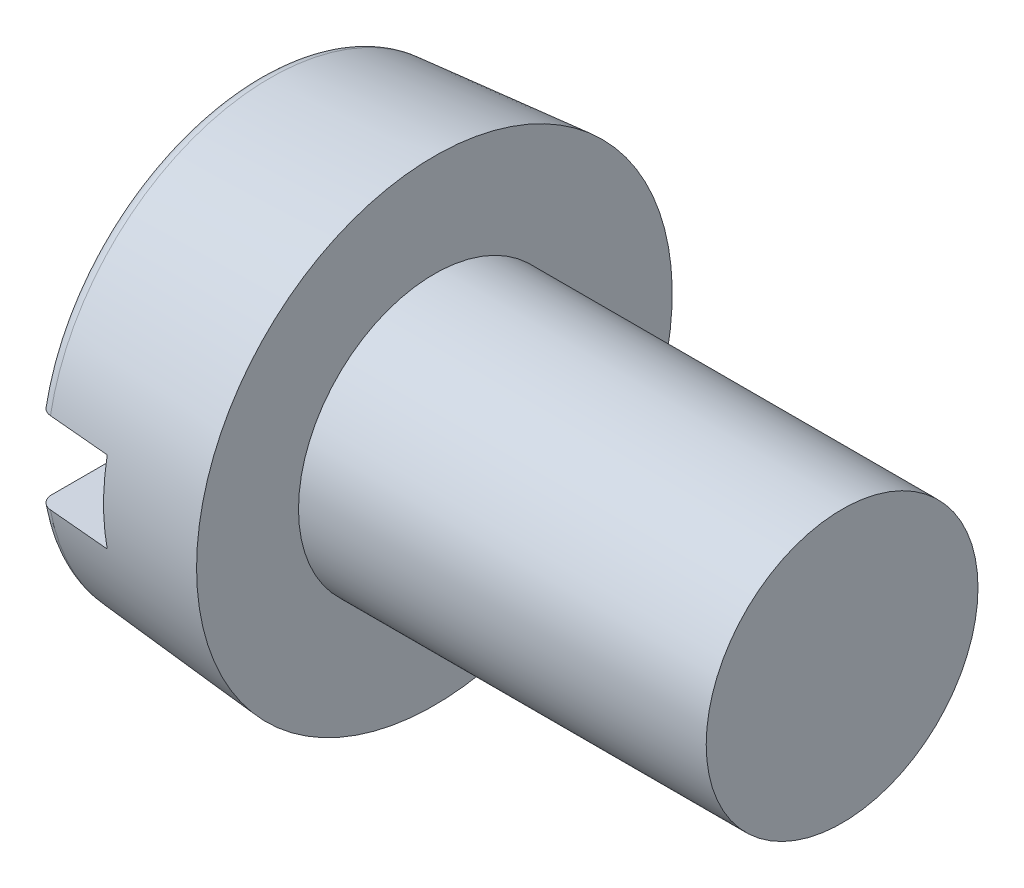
from build123d import *

# Parameters (mm, degrees)
FILLET2_R  = 0.2
SKETCH2_W  = 7
SKETCH2_H  = 1.2
SLOT_DEPTH = 1.1


with BuildPart() as part:
    # BodySke → Base-Revolve (revolve)
    with BuildSketch(Plane.XY, mode=Mode.PRIVATE) as base_revolve_sk:
        Polygon((2.6, 2), (2.6, 3.5), (0, 3.272529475), (0, 0), (8.6, 0), (8.6, 2), align=None)
    revolve(base_revolve_sk.sketch.rotate(Axis((-25.4, 0, 0), (1, 0, 0)), 90), axis=Axis((-25.4, 0, 0), (1, 0, 0)))

    # Fillet2
    fillet2_edges = [part.edges().sort_by_distance(p)[0] for p in [
        (0, 0, -3.272529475),
    ]]
    fillet(fillet2_edges, radius=FILLET2_R)

    # Sketch2 → Slot (cut)
    with BuildSketch(Plane(origin=(0, 0, 0), x_dir=(0, 0, -1), z_dir=(1, 0, 0))):
        Rectangle(SKETCH2_W, SKETCH2_H)
    extrude(amount=SLOT_DEPTH, mode=Mode.SUBTRACT)


solid = part.part
